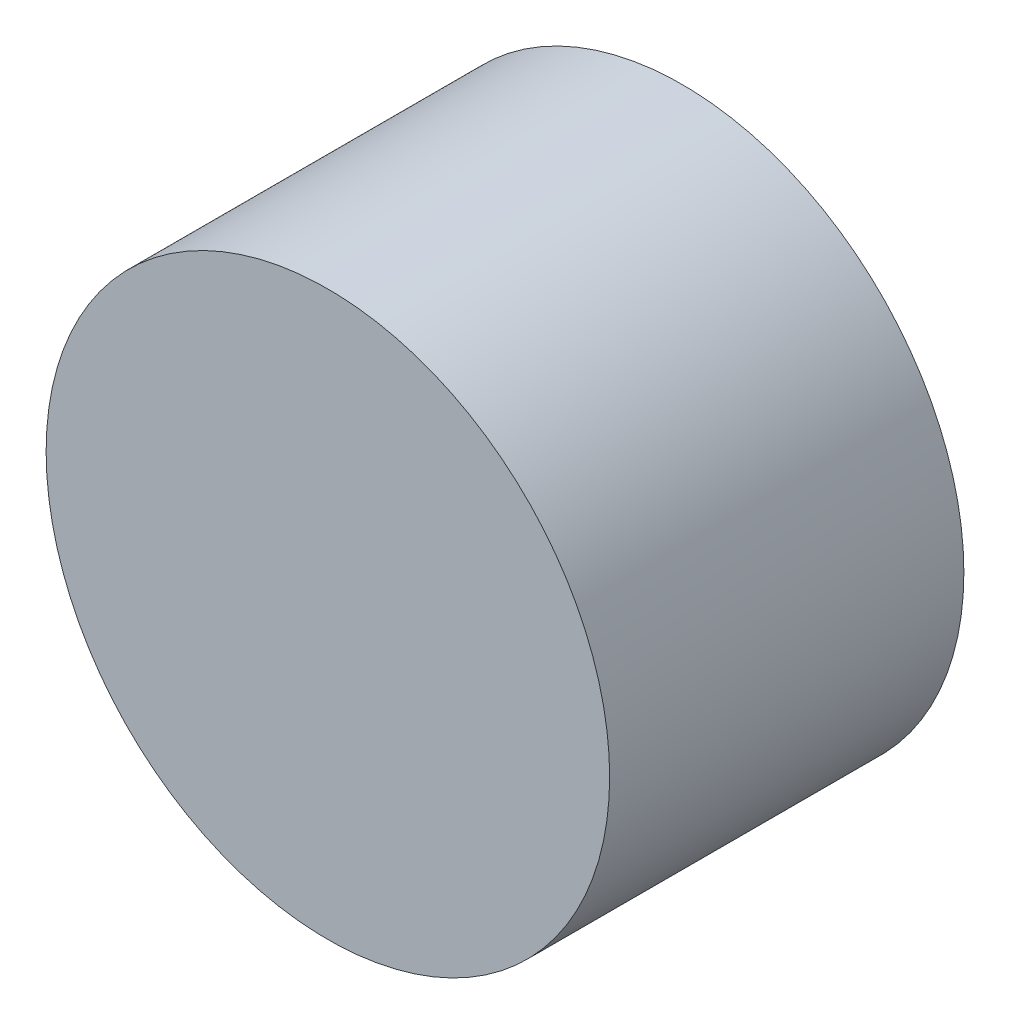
ISO-10303-21;
HEADER;
FILE_DESCRIPTION(('STEP AP214'),'2;1');
FILE_NAME('part.step','',(''),(''),'','','');
FILE_SCHEMA(('AUTOMOTIVE_DESIGN { 1 0 10303 214 1 1 1 1 }'));
ENDSEC;
DATA;
#1=APPLICATION_CONTEXT('core data for automotive mechanical design processes');
#2=APPLICATION_PROTOCOL_DEFINITION('international standard','automotive_design',2000,#1);
#3=PRODUCT_CONTEXT('',#1,'mechanical');
#4=PRODUCT('Part','Part','',(#3));
#5=PRODUCT_RELATED_PRODUCT_CATEGORY('part','',(#4));
#6=PRODUCT_DEFINITION_FORMATION('','',#4);
#7=PRODUCT_DEFINITION_CONTEXT('part definition',#1,'design');
#8=PRODUCT_DEFINITION('design','',#6,#7);
#9=PRODUCT_DEFINITION_SHAPE('','',#8);
#10=(LENGTH_UNIT() NAMED_UNIT(*) SI_UNIT(.MILLI.,.METRE.));
#11=(NAMED_UNIT(*) PLANE_ANGLE_UNIT() SI_UNIT($,.RADIAN.));
#12=(NAMED_UNIT(*) SI_UNIT($,.STERADIAN.) SOLID_ANGLE_UNIT());
#13=UNCERTAINTY_MEASURE_WITH_UNIT(LENGTH_MEASURE(1.E-05),#10,'distance_accuracy_value','');
#14=(GEOMETRIC_REPRESENTATION_CONTEXT(3) GLOBAL_UNCERTAINTY_ASSIGNED_CONTEXT((#13)) GLOBAL_UNIT_ASSIGNED_CONTEXT((#10,
#11,#12)) REPRESENTATION_CONTEXT('',''));
#15=CARTESIAN_POINT('',(0.,0.,0.));
#16=DIRECTION('',(0.,0.,1.));
#17=DIRECTION('',(1.,0.,0.));
#18=AXIS2_PLACEMENT_3D('',#15,#16,#17);
#19=CARTESIAN_POINT('',(0.,0.,0.));
#20=DIRECTION('',(0.,0.,1.));
#21=DIRECTION('',(1.,0.,0.));
#22=AXIS2_PLACEMENT_3D('',#19,#20,#21);
#23=CONICAL_SURFACE('',#22,20.5,0.0249947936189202);
#24=CARTESIAN_POINT('',(0.,0.,-20.));
#25=DIRECTION('',(0.,0.,1.));
#26=DIRECTION('',(1.,0.,0.));
#27=AXIS2_PLACEMENT_3D('',#24,#25,#26);
#28=CIRCLE('',#27,20.);
#29=CARTESIAN_POINT('',(20.,0.,-20.));
#30=VERTEX_POINT('',#29);
#31=EDGE_CURVE('E48',#30,#30,#28,.T.);
#32=ORIENTED_EDGE('',*,*,#31,.F.);
#33=EDGE_LOOP('',(#32));
#34=FACE_BOUND('',#33,.T.);
#35=CARTESIAN_POINT('',(0.,0.,0.));
#36=DIRECTION('',(0.,0.,1.));
#37=DIRECTION('',(1.,0.,0.));
#38=AXIS2_PLACEMENT_3D('',#35,#36,#37);
#39=CIRCLE('',#38,20.5);
#40=CARTESIAN_POINT('',(20.5,0.,0.));
#41=VERTEX_POINT('',#40);
#42=EDGE_CURVE('E10',#41,#41,#39,.T.);
#43=ORIENTED_EDGE('',*,*,#42,.T.);
#44=EDGE_LOOP('',(#43));
#45=FACE_BOUND('',#44,.T.);
#46=ADVANCED_FACE('F29',(#34,#45),#23,.F.);
#47=CARTESIAN_POINT('',(0.,0.,5.));
#48=DIRECTION('',(0.,0.,-1.));
#49=DIRECTION('',(-1.,0.,0.));
#50=AXIS2_PLACEMENT_3D('',#47,#48,#49);
#51=CONICAL_SURFACE('',#50,19.3922728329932,0.218023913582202);
#52=ORIENTED_EDGE('',*,*,#42,.F.);
#53=EDGE_LOOP('',(#52));
#54=FACE_BOUND('',#53,.T.);
#55=CARTESIAN_POINT('',(0.,0.,5.));
#56=DIRECTION('',(0.,0.,1.));
#57=DIRECTION('',(1.,0.,0.));
#58=AXIS2_PLACEMENT_3D('',#55,#56,#57);
#59=CIRCLE('',#58,19.3922728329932);
#60=CARTESIAN_POINT('',(19.3922728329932,0.,5.));
#61=VERTEX_POINT('',#60);
#62=EDGE_CURVE('E35',#61,#61,#59,.T.);
#63=ORIENTED_EDGE('',*,*,#62,.T.);
#64=EDGE_LOOP('',(#63));
#65=FACE_BOUND('',#64,.T.);
#66=ADVANCED_FACE('F73',(#54,#65),#51,.F.);
#67=CARTESIAN_POINT('',(0.,0.,0.));
#68=DIRECTION('',(0.,0.,1.));
#69=DIRECTION('',(1.,0.,0.));
#70=AXIS2_PLACEMENT_3D('',#67,#68,#69);
#71=CYLINDRICAL_SURFACE('',#70,19.3922728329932);
#72=ORIENTED_EDGE('',*,*,#62,.F.);
#73=EDGE_LOOP('',(#72));
#74=FACE_BOUND('',#73,.T.);
#75=CARTESIAN_POINT('',(0.,0.,13.));
#76=DIRECTION('',(0.,0.,1.));
#77=DIRECTION('',(1.,0.,0.));
#78=AXIS2_PLACEMENT_3D('',#75,#76,#77);
#79=CIRCLE('',#78,19.3922728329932);
#80=CARTESIAN_POINT('',(19.3922728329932,0.,13.));
#81=VERTEX_POINT('',#80);
#82=EDGE_CURVE('E51',#81,#81,#79,.F.);
#83=ORIENTED_EDGE('',*,*,#82,.F.);
#84=EDGE_LOOP('',(#83));
#85=FACE_BOUND('',#84,.T.);
#86=ADVANCED_FACE('F63',(#74,#85),#71,.F.);
#87=CARTESIAN_POINT('',(0.,0.,0.));
#88=DIRECTION('',(0.,0.,1.));
#89=DIRECTION('',(1.,0.,0.));
#90=AXIS2_PLACEMENT_3D('',#87,#88,#89);
#91=CYLINDRICAL_SURFACE('',#90,35.);
#92=CARTESIAN_POINT('',(0.,0.,-23.));
#93=DIRECTION('',(0.,0.,1.));
#94=DIRECTION('',(1.,0.,0.));
#95=AXIS2_PLACEMENT_3D('',#92,#93,#94);
#96=CIRCLE('',#95,35.);
#97=CARTESIAN_POINT('',(35.,0.,-23.));
#98=VERTEX_POINT('',#97);
#99=EDGE_CURVE('E39',#98,#98,#96,.T.);
#100=ORIENTED_EDGE('',*,*,#99,.T.);
#101=EDGE_LOOP('',(#100));
#102=FACE_BOUND('',#101,.T.);
#103=CARTESIAN_POINT('',(0.,0.,21.));
#104=DIRECTION('',(0.,0.,1.));
#105=DIRECTION('',(1.,0.,0.));
#106=AXIS2_PLACEMENT_3D('',#103,#104,#105);
#107=CIRCLE('',#106,35.);
#108=CARTESIAN_POINT('',(35.,0.,21.));
#109=VERTEX_POINT('',#108);
#110=EDGE_CURVE('E54',#109,#109,#107,.T.);
#111=ORIENTED_EDGE('',*,*,#110,.F.);
#112=EDGE_LOOP('',(#111));
#113=FACE_BOUND('',#112,.T.);
#114=ADVANCED_FACE('F60',(#102,#113),#91,.T.);
#115=CARTESIAN_POINT('',(-20.,0.,-23.));
#116=DIRECTION('',(0.,0.,1.));
#117=DIRECTION('',(1.,0.,0.));
#118=AXIS2_PLACEMENT_3D('',#115,#116,#117);
#119=PLANE('',#118);
#120=ORIENTED_EDGE('',*,*,#99,.F.);
#121=EDGE_LOOP('',(#120));
#122=FACE_BOUND('',#121,.T.);
#123=CARTESIAN_POINT('',(0.,0.,-23.));
#124=DIRECTION('',(0.,0.,1.));
#125=DIRECTION('',(1.,0.,0.));
#126=AXIS2_PLACEMENT_3D('',#123,#124,#125);
#127=CIRCLE('',#126,20.);
#128=CARTESIAN_POINT('',(20.,0.,-23.));
#129=VERTEX_POINT('',#128);
#130=EDGE_CURVE('E43',#129,#129,#127,.T.);
#131=ORIENTED_EDGE('',*,*,#130,.T.);
#132=EDGE_LOOP('',(#131));
#133=FACE_BOUND('',#132,.T.);
#134=ADVANCED_FACE('F62',(#122,#133),#119,.F.);
#135=CARTESIAN_POINT('',(0.,0.,0.));
#136=DIRECTION('',(0.,0.,1.));
#137=DIRECTION('',(1.,0.,0.));
#138=AXIS2_PLACEMENT_3D('',#135,#136,#137);
#139=CYLINDRICAL_SURFACE('',#138,20.);
#140=ORIENTED_EDGE('',*,*,#130,.F.);
#141=EDGE_LOOP('',(#140));
#142=FACE_BOUND('',#141,.T.);
#143=ORIENTED_EDGE('',*,*,#31,.T.);
#144=EDGE_LOOP('',(#143));
#145=FACE_BOUND('',#144,.T.);
#146=ADVANCED_FACE('F70',(#142,#145),#139,.F.);
#147=CARTESIAN_POINT('',(0.,0.,21.));
#148=DIRECTION('',(0.,0.,1.));
#149=DIRECTION('',(1.,0.,0.));
#150=AXIS2_PLACEMENT_3D('',#147,#148,#149);
#151=PLANE('',#150);
#152=ORIENTED_EDGE('',*,*,#110,.T.);
#153=EDGE_LOOP('',(#152));
#154=FACE_BOUND('',#153,.T.);
#155=ADVANCED_FACE('F58',(#154),#151,.T.);
#156=CARTESIAN_POINT('',(0.,0.,13.));
#157=DIRECTION('',(0.,0.,1.));
#158=DIRECTION('',(1.,0.,0.));
#159=AXIS2_PLACEMENT_3D('',#156,#157,#158);
#160=PLANE('',#159);
#161=ORIENTED_EDGE('',*,*,#82,.T.);
#162=EDGE_LOOP('',(#161));
#163=FACE_BOUND('',#162,.T.);
#164=ADVANCED_FACE('F90',(#163),#160,.F.);
#165=CLOSED_SHELL('',(#46,#66,#86,#114,#134,#146,#155,#164));
#166=MANIFOLD_SOLID_BREP('B2',#165);
#167=ADVANCED_BREP_SHAPE_REPRESENTATION('',(#18,#166),#14);
#168=SHAPE_DEFINITION_REPRESENTATION(#9,#167);
ENDSEC;
END-ISO-10303-21;
